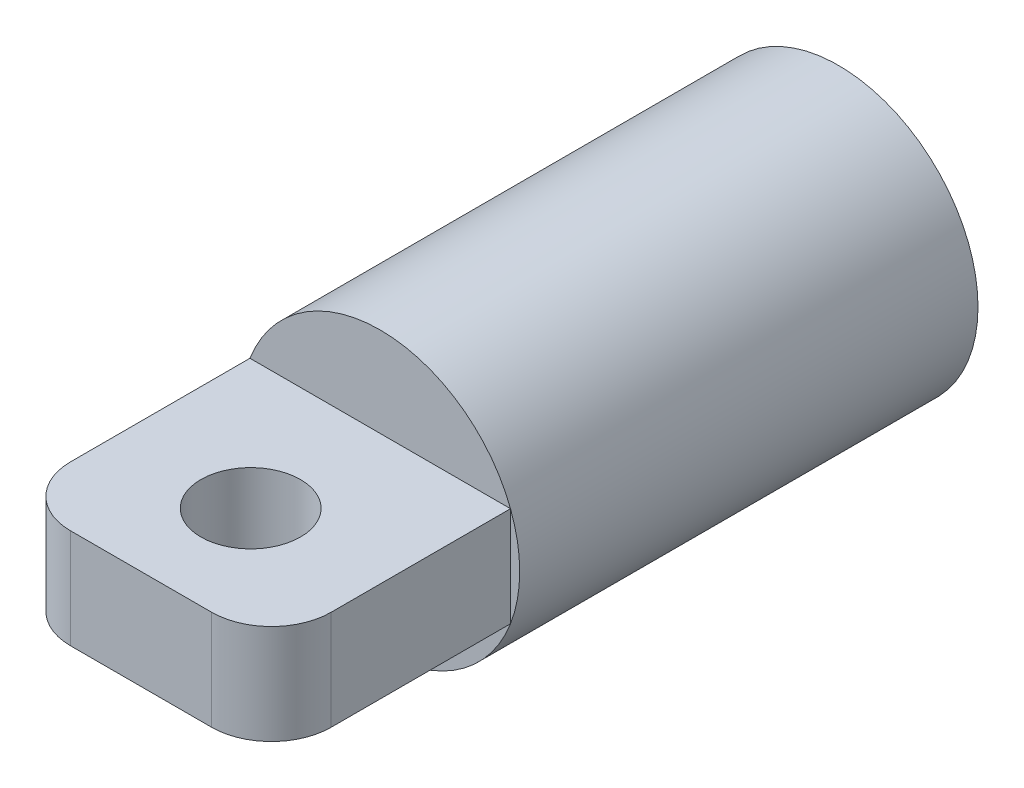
ISO-10303-21;
HEADER;
FILE_DESCRIPTION(('STEP AP214'),'2;1');
FILE_NAME('part.step','',(''),(''),'','','');
FILE_SCHEMA(('AUTOMOTIVE_DESIGN { 1 0 10303 214 1 1 1 1 }'));
ENDSEC;
DATA;
#1=APPLICATION_CONTEXT('core data for automotive mechanical design processes');
#2=APPLICATION_PROTOCOL_DEFINITION('international standard','automotive_design',2000,#1);
#3=PRODUCT_CONTEXT('',#1,'mechanical');
#4=PRODUCT('Part','Part','',(#3));
#5=PRODUCT_RELATED_PRODUCT_CATEGORY('part','',(#4));
#6=PRODUCT_DEFINITION_FORMATION('','',#4);
#7=PRODUCT_DEFINITION_CONTEXT('part definition',#1,'design');
#8=PRODUCT_DEFINITION('design','',#6,#7);
#9=PRODUCT_DEFINITION_SHAPE('','',#8);
#10=(LENGTH_UNIT() NAMED_UNIT(*) SI_UNIT(.MILLI.,.METRE.));
#11=(NAMED_UNIT(*) PLANE_ANGLE_UNIT() SI_UNIT($,.RADIAN.));
#12=(NAMED_UNIT(*) SI_UNIT($,.STERADIAN.) SOLID_ANGLE_UNIT());
#13=UNCERTAINTY_MEASURE_WITH_UNIT(LENGTH_MEASURE(1.E-05),#10,'distance_accuracy_value','');
#14=(GEOMETRIC_REPRESENTATION_CONTEXT(3) GLOBAL_UNCERTAINTY_ASSIGNED_CONTEXT((#13)) GLOBAL_UNIT_ASSIGNED_CONTEXT((#10,
#11,#12)) REPRESENTATION_CONTEXT('',''));
#15=CARTESIAN_POINT('',(0.,0.,0.));
#16=DIRECTION('',(0.,0.,1.));
#17=DIRECTION('',(1.,0.,0.));
#18=AXIS2_PLACEMENT_3D('',#15,#16,#17);
#19=CARTESIAN_POINT('',(0.,0.,35.));
#20=DIRECTION('',(0.,0.,-1.));
#21=DIRECTION('',(-1.,0.,0.));
#22=AXIS2_PLACEMENT_3D('',#19,#20,#21);
#23=CYLINDRICAL_SURFACE('',#22,7.);
#24=CARTESIAN_POINT('',(0.,0.,0.));
#25=DIRECTION('',(0.,0.,1.));
#26=DIRECTION('',(1.,0.,0.));
#27=AXIS2_PLACEMENT_3D('',#24,#25,#26);
#28=CIRCLE('',#27,7.);
#29=CARTESIAN_POINT('',(7.,0.,0.));
#30=VERTEX_POINT('',#29);
#31=EDGE_CURVE('E129',#30,#30,#28,.T.);
#32=ORIENTED_EDGE('',*,*,#31,.T.);
#33=EDGE_LOOP('',(#32));
#34=FACE_BOUND('',#33,.T.);
#35=CARTESIAN_POINT('',(0.,0.,23.));
#36=DIRECTION('',(0.,0.,1.));
#37=DIRECTION('',(1.,0.,0.));
#38=AXIS2_PLACEMENT_3D('',#35,#36,#37);
#39=CIRCLE('',#38,7.);
#40=CARTESIAN_POINT('',(6.53834841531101,2.5,23.));
#41=VERTEX_POINT('',#40);
#42=CARTESIAN_POINT('',(-6.53834841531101,2.5,23.));
#43=VERTEX_POINT('',#42);
#44=EDGE_CURVE('E97',#41,#43,#39,.T.);
#45=ORIENTED_EDGE('',*,*,#44,.F.);
#46=CARTESIAN_POINT('',(6.53834841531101,-2.5,23.));
#47=VERTEX_POINT('',#46);
#48=EDGE_CURVE('E89',#47,#41,#39,.T.);
#49=ORIENTED_EDGE('',*,*,#48,.F.);
#50=CARTESIAN_POINT('',(-6.53834841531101,-2.5,23.));
#51=VERTEX_POINT('',#50);
#52=EDGE_CURVE('E98',#51,#47,#39,.T.);
#53=ORIENTED_EDGE('',*,*,#52,.F.);
#54=EDGE_CURVE('E123',#43,#51,#39,.T.);
#55=ORIENTED_EDGE('',*,*,#54,.F.);
#56=EDGE_LOOP('',(#45,#49,#53,#55));
#57=FACE_BOUND('',#56,.T.);
#58=ADVANCED_FACE('F33',(#34,#57),#23,.T.);
#59=CARTESIAN_POINT('',(0.,0.,0.));
#60=DIRECTION('',(0.,0.,1.));
#61=DIRECTION('',(1.,0.,0.));
#62=AXIS2_PLACEMENT_3D('',#59,#60,#61);
#63=PLANE('',#62);
#64=ORIENTED_EDGE('',*,*,#31,.F.);
#65=EDGE_LOOP('',(#64));
#66=FACE_BOUND('',#65,.T.);
#67=ADVANCED_FACE('F172',(#66),#63,.F.);
#68=CARTESIAN_POINT('',(0.,0.,23.));
#69=DIRECTION('',(0.,0.,1.));
#70=DIRECTION('',(1.,0.,0.));
#71=AXIS2_PLACEMENT_3D('',#68,#69,#70);
#72=PLANE('',#71);
#73=ORIENTED_EDGE('',*,*,#44,.T.);
#74=DIRECTION('',(-1.,0.,0.));
#75=VECTOR('',#74,1.);
#76=CARTESIAN_POINT('',(-6.53834841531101,2.5,23.));
#77=LINE('',#76,#75);
#78=EDGE_CURVE('E107',#41,#43,#77,.T.);
#79=ORIENTED_EDGE('',*,*,#78,.F.);
#80=EDGE_LOOP('',(#73,#79));
#81=FACE_BOUND('',#80,.T.);
#82=ADVANCED_FACE('F114',(#81),#72,.T.);
#83=ORIENTED_EDGE('',*,*,#54,.T.);
#84=DIRECTION('',(0.,-1.,0.));
#85=VECTOR('',#84,1.);
#86=CARTESIAN_POINT('',(-6.53834841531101,-2.5,23.));
#87=LINE('',#86,#85);
#88=EDGE_CURVE('E116',#43,#51,#87,.T.);
#89=ORIENTED_EDGE('',*,*,#88,.F.);
#90=EDGE_LOOP('',(#83,#89));
#91=FACE_BOUND('',#90,.T.);
#92=ADVANCED_FACE('F259',(#91),#72,.T.);
#93=ORIENTED_EDGE('',*,*,#52,.T.);
#94=DIRECTION('',(1.,0.,0.));
#95=VECTOR('',#94,1.);
#96=CARTESIAN_POINT('',(-6.53834841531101,-2.5,23.));
#97=LINE('',#96,#95);
#98=EDGE_CURVE('E111',#51,#47,#97,.T.);
#99=ORIENTED_EDGE('',*,*,#98,.F.);
#100=EDGE_LOOP('',(#93,#99));
#101=FACE_BOUND('',#100,.T.);
#102=ADVANCED_FACE('F267',(#101),#72,.T.);
#103=ORIENTED_EDGE('',*,*,#48,.T.);
#104=DIRECTION('',(0.,1.,0.));
#105=VECTOR('',#104,1.);
#106=CARTESIAN_POINT('',(6.53834841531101,-2.5,23.));
#107=LINE('',#106,#105);
#108=EDGE_CURVE('E93',#47,#41,#107,.T.);
#109=ORIENTED_EDGE('',*,*,#108,.F.);
#110=EDGE_LOOP('',(#103,#109));
#111=FACE_BOUND('',#110,.T.);
#112=ADVANCED_FACE('F91',(#111),#72,.T.);
#113=CARTESIAN_POINT('',(6.53834841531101,-2.5,23.));
#114=DIRECTION('',(1.,0.,0.));
#115=DIRECTION('',(0.,0.,-1.));
#116=AXIS2_PLACEMENT_3D('',#113,#114,#115);
#117=PLANE('',#116);
#118=DIRECTION('',(0.,0.,1.));
#119=VECTOR('',#118,1.);
#120=CARTESIAN_POINT('',(6.53834841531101,2.5,23.));
#121=LINE('',#120,#119);
#122=CARTESIAN_POINT('',(6.53834841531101,2.5,32.));
#123=VERTEX_POINT('',#122);
#124=EDGE_CURVE('E102',#41,#123,#121,.T.);
#125=ORIENTED_EDGE('',*,*,#124,.T.);
#126=DIRECTION('',(0.,1.,0.));
#127=VECTOR('',#126,1.);
#128=CARTESIAN_POINT('',(6.53834841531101,-2.5,32.));
#129=LINE('',#128,#127);
#130=CARTESIAN_POINT('',(6.53834841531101,-2.5,32.));
#131=VERTEX_POINT('',#130);
#132=EDGE_CURVE('E57',#123,#131,#129,.F.);
#133=ORIENTED_EDGE('',*,*,#132,.T.);
#134=DIRECTION('',(0.,0.,1.));
#135=VECTOR('',#134,1.);
#136=CARTESIAN_POINT('',(6.53834841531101,-2.5,23.));
#137=LINE('',#136,#135);
#138=EDGE_CURVE('E119',#47,#131,#137,.T.);
#139=ORIENTED_EDGE('',*,*,#138,.F.);
#140=ORIENTED_EDGE('',*,*,#108,.T.);
#141=EDGE_LOOP('',(#125,#133,#139,#140));
#142=FACE_BOUND('',#141,.T.);
#143=ADVANCED_FACE('F118',(#142),#117,.T.);
#144=CARTESIAN_POINT('',(-6.53834841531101,-2.5,23.));
#145=DIRECTION('',(0.,-1.,0.));
#146=DIRECTION('',(0.,0.,-1.));
#147=AXIS2_PLACEMENT_3D('',#144,#145,#146);
#148=PLANE('',#147);
#149=CARTESIAN_POINT('',(0.,-2.5,29.5));
#150=DIRECTION('',(0.,-1.,0.));
#151=DIRECTION('',(0.,0.,-1.));
#152=AXIS2_PLACEMENT_3D('',#149,#150,#151);
#153=CIRCLE('',#152,2.5);
#154=CARTESIAN_POINT('',(0.,-2.5,27.));
#155=VERTEX_POINT('',#154);
#156=EDGE_CURVE('E147',#155,#155,#153,.T.);
#157=ORIENTED_EDGE('',*,*,#156,.F.);
#158=EDGE_LOOP('',(#157));
#159=FACE_BOUND('',#158,.T.);
#160=ORIENTED_EDGE('',*,*,#138,.T.);
#161=CARTESIAN_POINT('',(3.53834841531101,-2.5,32.));
#162=DIRECTION('',(0.,-1.,0.));
#163=DIRECTION('',(0.,0.,-1.));
#164=AXIS2_PLACEMENT_3D('',#161,#162,#163);
#165=CIRCLE('',#164,3.);
#166=CARTESIAN_POINT('',(3.53834841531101,-2.5,35.));
#167=VERTEX_POINT('',#166);
#168=EDGE_CURVE('E42',#131,#167,#165,.T.);
#169=ORIENTED_EDGE('',*,*,#168,.T.);
#170=DIRECTION('',(1.,0.,0.));
#171=VECTOR('',#170,1.);
#172=CARTESIAN_POINT('',(-6.53834841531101,-2.5,35.));
#173=LINE('',#172,#171);
#174=CARTESIAN_POINT('',(-3.53834841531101,-2.5,35.));
#175=VERTEX_POINT('',#174);
#176=EDGE_CURVE('E121',#175,#167,#173,.T.);
#177=ORIENTED_EDGE('',*,*,#176,.F.);
#178=CARTESIAN_POINT('',(-3.53834841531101,-2.5,32.));
#179=DIRECTION('',(0.,-1.,0.));
#180=DIRECTION('',(0.,0.,-1.));
#181=AXIS2_PLACEMENT_3D('',#178,#179,#180);
#182=CIRCLE('',#181,3.);
#183=CARTESIAN_POINT('',(-6.53834841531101,-2.5,32.));
#184=VERTEX_POINT('',#183);
#185=EDGE_CURVE('E49',#175,#184,#182,.T.);
#186=ORIENTED_EDGE('',*,*,#185,.T.);
#187=DIRECTION('',(0.,0.,1.));
#188=VECTOR('',#187,1.);
#189=CARTESIAN_POINT('',(-6.53834841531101,-2.5,23.));
#190=LINE('',#189,#188);
#191=EDGE_CURVE('E134',#51,#184,#190,.T.);
#192=ORIENTED_EDGE('',*,*,#191,.F.);
#193=ORIENTED_EDGE('',*,*,#98,.T.);
#194=EDGE_LOOP('',(#160,#169,#177,#186,#192,#193));
#195=FACE_BOUND('',#194,.T.);
#196=ADVANCED_FACE('F167',(#159,#195),#148,.T.);
#197=CARTESIAN_POINT('',(-6.53834841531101,-2.5,23.));
#198=DIRECTION('',(-1.,0.,0.));
#199=DIRECTION('',(0.,0.,1.));
#200=AXIS2_PLACEMENT_3D('',#197,#198,#199);
#201=PLANE('',#200);
#202=ORIENTED_EDGE('',*,*,#191,.T.);
#203=DIRECTION('',(0.,-1.,0.));
#204=VECTOR('',#203,1.);
#205=CARTESIAN_POINT('',(-6.53834841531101,-2.5,32.));
#206=LINE('',#205,#204);
#207=CARTESIAN_POINT('',(-6.53834841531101,2.5,32.));
#208=VERTEX_POINT('',#207);
#209=EDGE_CURVE('E12',#184,#208,#206,.F.);
#210=ORIENTED_EDGE('',*,*,#209,.T.);
#211=DIRECTION('',(0.,0.,1.));
#212=VECTOR('',#211,1.);
#213=CARTESIAN_POINT('',(-6.53834841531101,2.5,23.));
#214=LINE('',#213,#212);
#215=EDGE_CURVE('E110',#43,#208,#214,.T.);
#216=ORIENTED_EDGE('',*,*,#215,.F.);
#217=ORIENTED_EDGE('',*,*,#88,.T.);
#218=EDGE_LOOP('',(#202,#210,#216,#217));
#219=FACE_BOUND('',#218,.T.);
#220=ADVANCED_FACE('F158',(#219),#201,.T.);
#221=CARTESIAN_POINT('',(-6.53834841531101,2.5,23.));
#222=DIRECTION('',(0.,1.,0.));
#223=DIRECTION('',(0.,0.,1.));
#224=AXIS2_PLACEMENT_3D('',#221,#222,#223);
#225=PLANE('',#224);
#226=CARTESIAN_POINT('',(0.,2.5,29.5));
#227=DIRECTION('',(0.,1.,0.));
#228=DIRECTION('',(0.,0.,1.));
#229=AXIS2_PLACEMENT_3D('',#226,#227,#228);
#230=CIRCLE('',#229,2.5);
#231=CARTESIAN_POINT('',(0.,2.5,32.));
#232=VERTEX_POINT('',#231);
#233=EDGE_CURVE('E37',#232,#232,#230,.T.);
#234=ORIENTED_EDGE('',*,*,#233,.F.);
#235=EDGE_LOOP('',(#234));
#236=FACE_BOUND('',#235,.T.);
#237=DIRECTION('',(-1.,0.,0.));
#238=VECTOR('',#237,1.);
#239=CARTESIAN_POINT('',(-6.53834841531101,2.5,35.));
#240=LINE('',#239,#238);
#241=CARTESIAN_POINT('',(3.53834841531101,2.5,35.));
#242=VERTEX_POINT('',#241);
#243=CARTESIAN_POINT('',(-3.53834841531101,2.5,35.));
#244=VERTEX_POINT('',#243);
#245=EDGE_CURVE('E141',#242,#244,#240,.T.);
#246=ORIENTED_EDGE('',*,*,#245,.F.);
#247=CARTESIAN_POINT('',(3.53834841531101,2.5,32.));
#248=DIRECTION('',(0.,1.,0.));
#249=DIRECTION('',(0.,0.,1.));
#250=AXIS2_PLACEMENT_3D('',#247,#248,#249);
#251=CIRCLE('',#250,3.);
#252=EDGE_CURVE('E109',#242,#123,#251,.T.);
#253=ORIENTED_EDGE('',*,*,#252,.T.);
#254=ORIENTED_EDGE('',*,*,#124,.F.);
#255=ORIENTED_EDGE('',*,*,#78,.T.);
#256=ORIENTED_EDGE('',*,*,#215,.T.);
#257=CARTESIAN_POINT('',(-3.53834841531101,2.5,32.));
#258=DIRECTION('',(0.,1.,0.));
#259=DIRECTION('',(0.,0.,1.));
#260=AXIS2_PLACEMENT_3D('',#257,#258,#259);
#261=CIRCLE('',#260,3.);
#262=EDGE_CURVE('E193',#208,#244,#261,.T.);
#263=ORIENTED_EDGE('',*,*,#262,.T.);
#264=EDGE_LOOP('',(#246,#253,#254,#255,#256,#263));
#265=FACE_BOUND('',#264,.T.);
#266=ADVANCED_FACE('F105',(#236,#265),#225,.T.);
#267=CARTESIAN_POINT('',(0.,0.,35.));
#268=DIRECTION('',(0.,0.,1.));
#269=DIRECTION('',(1.,0.,0.));
#270=AXIS2_PLACEMENT_3D('',#267,#268,#269);
#271=PLANE('',#270);
#272=ORIENTED_EDGE('',*,*,#176,.T.);
#273=DIRECTION('',(0.,1.,0.));
#274=VECTOR('',#273,1.);
#275=CARTESIAN_POINT('',(3.53834841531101,0.,35.));
#276=LINE('',#275,#274);
#277=EDGE_CURVE('E126',#167,#242,#276,.T.);
#278=ORIENTED_EDGE('',*,*,#277,.T.);
#279=ORIENTED_EDGE('',*,*,#245,.T.);
#280=DIRECTION('',(0.,-1.,0.));
#281=VECTOR('',#280,1.);
#282=CARTESIAN_POINT('',(-3.53834841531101,0.,35.));
#283=LINE('',#282,#281);
#284=EDGE_CURVE('E124',#244,#175,#283,.T.);
#285=ORIENTED_EDGE('',*,*,#284,.T.);
#286=EDGE_LOOP('',(#272,#278,#279,#285));
#287=FACE_BOUND('',#286,.T.);
#288=ADVANCED_FACE('F157',(#287),#271,.T.);
#289=CARTESIAN_POINT('',(3.53834841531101,0.,32.));
#290=DIRECTION('',(0.,1.,0.));
#291=DIRECTION('',(0.,0.,1.));
#292=AXIS2_PLACEMENT_3D('',#289,#290,#291);
#293=CYLINDRICAL_SURFACE('',#292,3.);
#294=ORIENTED_EDGE('',*,*,#168,.F.);
#295=ORIENTED_EDGE('',*,*,#132,.F.);
#296=ORIENTED_EDGE('',*,*,#252,.F.);
#297=ORIENTED_EDGE('',*,*,#277,.F.);
#298=EDGE_LOOP('',(#294,#295,#296,#297));
#299=FACE_BOUND('',#298,.T.);
#300=ADVANCED_FACE('F164',(#299),#293,.T.);
#301=CARTESIAN_POINT('',(-3.53834841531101,0.,32.));
#302=DIRECTION('',(0.,-1.,0.));
#303=DIRECTION('',(0.,0.,-1.));
#304=AXIS2_PLACEMENT_3D('',#301,#302,#303);
#305=CYLINDRICAL_SURFACE('',#304,3.);
#306=ORIENTED_EDGE('',*,*,#262,.F.);
#307=ORIENTED_EDGE('',*,*,#209,.F.);
#308=ORIENTED_EDGE('',*,*,#185,.F.);
#309=ORIENTED_EDGE('',*,*,#284,.F.);
#310=EDGE_LOOP('',(#306,#307,#308,#309));
#311=FACE_BOUND('',#310,.T.);
#312=ADVANCED_FACE('F35',(#311),#305,.T.);
#313=CARTESIAN_POINT('',(0.,5.5,29.5));
#314=DIRECTION('',(0.,-1.,0.));
#315=DIRECTION('',(0.,0.,-1.));
#316=AXIS2_PLACEMENT_3D('',#313,#314,#315);
#317=CYLINDRICAL_SURFACE('',#316,2.5);
#318=ORIENTED_EDGE('',*,*,#233,.T.);
#319=EDGE_LOOP('',(#318));
#320=FACE_BOUND('',#319,.T.);
#321=ORIENTED_EDGE('',*,*,#156,.T.);
#322=EDGE_LOOP('',(#321));
#323=FACE_BOUND('',#322,.T.);
#324=ADVANCED_FACE('F154',(#320,#323),#317,.F.);
#325=CLOSED_SHELL('',(#58,#67,#82,#92,#102,#112,#143,#196,#220,#266,#288,#300,#312,#324));
#326=MANIFOLD_SOLID_BREP('B2',#325);
#327=ADVANCED_BREP_SHAPE_REPRESENTATION('',(#18,#326),#14);
#328=SHAPE_DEFINITION_REPRESENTATION(#9,#327);
ENDSEC;
END-ISO-10303-21;
